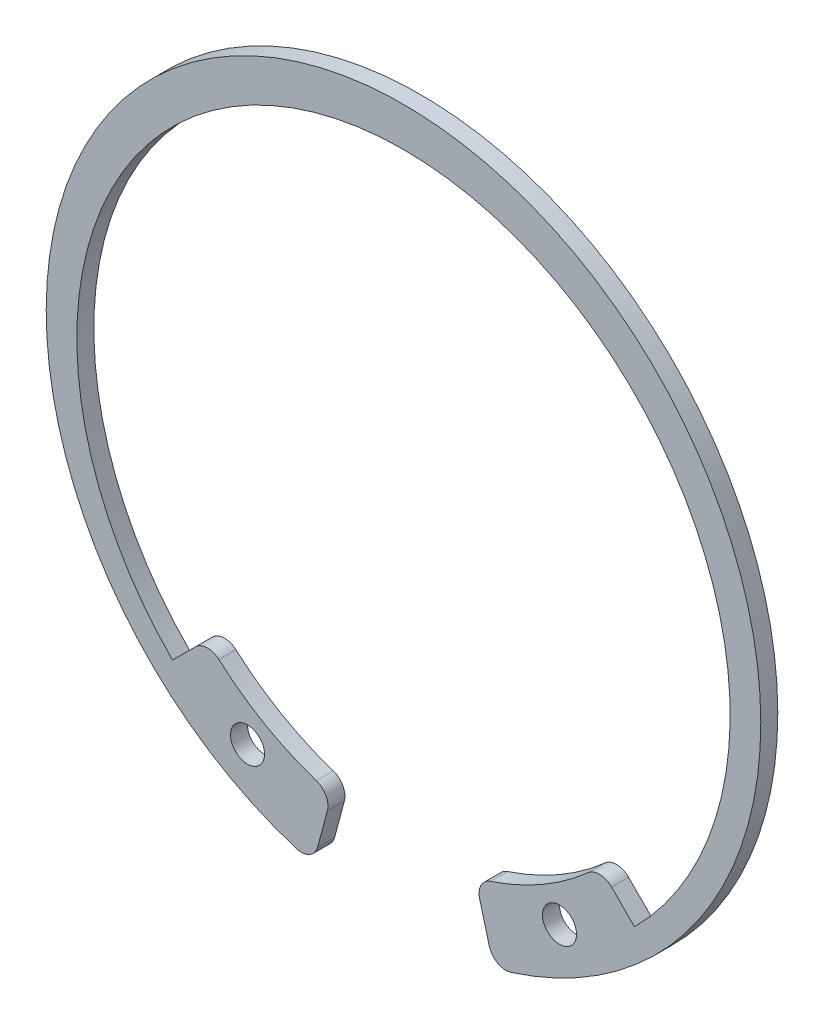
ISO-10303-21;
HEADER;
FILE_DESCRIPTION(('STEP AP214'),'2;1');
FILE_NAME('part.step','',(''),(''),'','','');
FILE_SCHEMA(('AUTOMOTIVE_DESIGN { 1 0 10303 214 1 1 1 1 }'));
ENDSEC;
DATA;
#1=APPLICATION_CONTEXT('core data for automotive mechanical design processes');
#2=APPLICATION_PROTOCOL_DEFINITION('international standard','automotive_design',2000,#1);
#3=PRODUCT_CONTEXT('',#1,'mechanical');
#4=PRODUCT('Part','Part','',(#3));
#5=PRODUCT_RELATED_PRODUCT_CATEGORY('part','',(#4));
#6=PRODUCT_DEFINITION_FORMATION('','',#4);
#7=PRODUCT_DEFINITION_CONTEXT('part definition',#1,'design');
#8=PRODUCT_DEFINITION('design','',#6,#7);
#9=PRODUCT_DEFINITION_SHAPE('','',#8);
#10=(LENGTH_UNIT() NAMED_UNIT(*) SI_UNIT(.MILLI.,.METRE.));
#11=(NAMED_UNIT(*) PLANE_ANGLE_UNIT() SI_UNIT($,.RADIAN.));
#12=(NAMED_UNIT(*) SI_UNIT($,.STERADIAN.) SOLID_ANGLE_UNIT());
#13=UNCERTAINTY_MEASURE_WITH_UNIT(LENGTH_MEASURE(1.E-05),#10,'distance_accuracy_value','');
#14=(GEOMETRIC_REPRESENTATION_CONTEXT(3) GLOBAL_UNCERTAINTY_ASSIGNED_CONTEXT((#13)) GLOBAL_UNIT_ASSIGNED_CONTEXT((#10,
#11,#12)) REPRESENTATION_CONTEXT('',''));
#15=CARTESIAN_POINT('',(0.,0.,0.));
#16=DIRECTION('',(0.,0.,1.));
#17=DIRECTION('',(1.,0.,0.));
#18=AXIS2_PLACEMENT_3D('',#15,#16,#17);
#19=CARTESIAN_POINT('',(11.5171715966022,-12.9313851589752,1.));
#20=DIRECTION('',(0.,0.,-1.));
#21=DIRECTION('',(-1.,0.,0.));
#22=AXIS2_PLACEMENT_3D('',#19,#20,#21);
#23=PLANE('',#22);
#24=CARTESIAN_POINT('',(-9.16844281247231,-15.6713185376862,1.));
#25=DIRECTION('',(0.,0.,1.));
#26=DIRECTION('',(1.,0.,0.));
#27=AXIS2_PLACEMENT_3D('',#24,#25,#26);
#28=CIRCLE('',#27,1.);
#29=CARTESIAN_POINT('',(-8.16844281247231,-15.6713185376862,1.));
#30=VERTEX_POINT('',#29);
#31=EDGE_CURVE('E150',#30,#30,#28,.T.);
#32=ORIENTED_EDGE('',*,*,#31,.F.);
#33=EDGE_LOOP('',(#32));
#34=FACE_BOUND('',#33,.T.);
#35=CARTESIAN_POINT('',(11.5171715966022,-12.9313851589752,1.));
#36=DIRECTION('',(0.,0.,1.));
#37=DIRECTION('',(-1.,0.,0.));
#38=AXIS2_PLACEMENT_3D('',#35,#36,#37);
#39=CIRCLE('',#38,1.);
#40=CARTESIAN_POINT('',(12.2242783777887,-12.2242783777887,1.));
#41=VERTEX_POINT('',#40);
#42=CARTESIAN_POINT('',(10.8520787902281,-12.184624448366,1.));
#43=VERTEX_POINT('',#42);
#44=EDGE_CURVE('E180',#41,#43,#39,.T.);
#45=ORIENTED_EDGE('',*,*,#44,.T.);
#46=CARTESIAN_POINT('',(0.,0.,1.));
#47=DIRECTION('',(0.,0.,-1.));
#48=DIRECTION('',(1.,0.,0.));
#49=AXIS2_PLACEMENT_3D('',#46,#47,#48);
#50=CIRCLE('',#49,16.3166383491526);
#51=CARTESIAN_POINT('',(5.12615491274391,-15.4904881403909,1.));
#52=VERTEX_POINT('',#51);
#53=EDGE_CURVE('E145',#43,#52,#50,.T.);
#54=ORIENTED_EDGE('',*,*,#53,.T.);
#55=CARTESIAN_POINT('',(5.44032225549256,-16.4398557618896,1.));
#56=DIRECTION('',(0.,0.,1.));
#57=DIRECTION('',(-1.,0.,0.));
#58=AXIS2_PLACEMENT_3D('',#55,#56,#57);
#59=CIRCLE('',#58,1.);
#60=CARTESIAN_POINT('',(4.4743964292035,-16.6986748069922,1.));
#61=VERTEX_POINT('',#60);
#62=EDGE_CURVE('E183',#52,#61,#59,.T.);
#63=ORIENTED_EDGE('',*,*,#62,.T.);
#64=DIRECTION('',(0.258819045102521,-0.965925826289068,0.));
#65=VECTOR('',#64,1.);
#66=CARTESIAN_POINT('',(5.04647442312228,-18.8336989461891,1.));
#67=LINE('',#66,#65);
#68=CARTESIAN_POINT('',(5.04647442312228,-18.8336989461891,1.));
#69=VERTEX_POINT('',#68);
#70=EDGE_CURVE('E185',#61,#69,#67,.T.);
#71=ORIENTED_EDGE('',*,*,#70,.T.);
#72=CARTESIAN_POINT('',(6.01240024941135,-18.5748799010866,1.));
#73=DIRECTION('',(0.,0.,1.));
#74=DIRECTION('',(-1.,0.,0.));
#75=AXIS2_PLACEMENT_3D('',#72,#73,#74);
#76=CIRCLE('',#75,1.);
#77=CARTESIAN_POINT('',(6.31302026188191,-19.528623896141,1.));
#78=VERTEX_POINT('',#77);
#79=EDGE_CURVE('E187',#69,#78,#76,.T.);
#80=ORIENTED_EDGE('',*,*,#79,.T.);
#81=CARTESIAN_POINT('',(0.,0.5,1.));
#82=DIRECTION('',(0.,0.,1.));
#83=DIRECTION('',(1.,0.,0.));
#84=AXIS2_PLACEMENT_3D('',#81,#82,#83);
#85=CIRCLE('',#84,21.);
#86=CARTESIAN_POINT('',(-6.31302026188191,-19.528623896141,1.));
#87=VERTEX_POINT('',#86);
#88=EDGE_CURVE('E189',#78,#87,#85,.T.);
#89=ORIENTED_EDGE('',*,*,#88,.T.);
#90=CARTESIAN_POINT('',(-6.01240024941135,-18.5748799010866,1.));
#91=DIRECTION('',(0.,0.,1.));
#92=DIRECTION('',(1.,0.,0.));
#93=AXIS2_PLACEMENT_3D('',#90,#91,#92);
#94=CIRCLE('',#93,1.);
#95=CARTESIAN_POINT('',(-5.04647442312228,-18.8336989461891,1.));
#96=VERTEX_POINT('',#95);
#97=EDGE_CURVE('E191',#87,#96,#94,.T.);
#98=ORIENTED_EDGE('',*,*,#97,.T.);
#99=DIRECTION('',(0.258819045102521,0.965925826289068,0.));
#100=VECTOR('',#99,1.);
#101=CARTESIAN_POINT('',(-5.04647442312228,-18.8336989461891,1.));
#102=LINE('',#101,#100);
#103=CARTESIAN_POINT('',(-4.4743964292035,-16.6986748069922,1.));
#104=VERTEX_POINT('',#103);
#105=EDGE_CURVE('E193',#96,#104,#102,.T.);
#106=ORIENTED_EDGE('',*,*,#105,.T.);
#107=CARTESIAN_POINT('',(-5.44032225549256,-16.4398557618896,1.));
#108=DIRECTION('',(0.,0.,1.));
#109=DIRECTION('',(1.,0.,0.));
#110=AXIS2_PLACEMENT_3D('',#107,#108,#109);
#111=CIRCLE('',#110,1.);
#112=CARTESIAN_POINT('',(-5.12615491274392,-15.4904881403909,1.));
#113=VERTEX_POINT('',#112);
#114=EDGE_CURVE('E195',#104,#113,#111,.T.);
#115=ORIENTED_EDGE('',*,*,#114,.T.);
#116=CARTESIAN_POINT('',(0.,0.,1.));
#117=DIRECTION('',(0.,0.,-1.));
#118=DIRECTION('',(1.,0.,0.));
#119=AXIS2_PLACEMENT_3D('',#116,#117,#118);
#120=CIRCLE('',#119,16.3166383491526);
#121=CARTESIAN_POINT('',(-10.8520787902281,-12.184624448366,1.));
#122=VERTEX_POINT('',#121);
#123=EDGE_CURVE('E197',#113,#122,#120,.T.);
#124=ORIENTED_EDGE('',*,*,#123,.T.);
#125=CARTESIAN_POINT('',(-11.5171715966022,-12.9313851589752,1.));
#126=DIRECTION('',(0.,0.,1.));
#127=DIRECTION('',(-1.,0.,0.));
#128=AXIS2_PLACEMENT_3D('',#125,#126,#127);
#129=CIRCLE('',#128,1.);
#130=CARTESIAN_POINT('',(-12.2242783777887,-12.2242783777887,1.));
#131=VERTEX_POINT('',#130);
#132=EDGE_CURVE('E199',#122,#131,#129,.T.);
#133=ORIENTED_EDGE('',*,*,#132,.T.);
#134=DIRECTION('',(-0.707106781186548,-0.707106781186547,0.));
#135=VECTOR('',#134,1.);
#136=CARTESIAN_POINT('',(-12.2242783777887,-12.2242783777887,1.));
#137=LINE('',#136,#135);
#138=CARTESIAN_POINT('',(-13.5764501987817,-13.5764501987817,1.));
#139=VERTEX_POINT('',#138);
#140=EDGE_CURVE('E201',#131,#139,#137,.T.);
#141=ORIENTED_EDGE('',*,*,#140,.T.);
#142=CARTESIAN_POINT('',(0.,0.,1.));
#143=DIRECTION('',(0.,0.,-1.));
#144=DIRECTION('',(1.,0.,0.));
#145=AXIS2_PLACEMENT_3D('',#142,#143,#144);
#146=CIRCLE('',#145,19.2);
#147=CARTESIAN_POINT('',(13.5764501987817,-13.5764501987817,1.));
#148=VERTEX_POINT('',#147);
#149=EDGE_CURVE('E50',#139,#148,#146,.T.);
#150=ORIENTED_EDGE('',*,*,#149,.T.);
#151=DIRECTION('',(-0.707106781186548,0.707106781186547,0.));
#152=VECTOR('',#151,1.);
#153=CARTESIAN_POINT('',(12.2242783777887,-12.2242783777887,1.));
#154=LINE('',#153,#152);
#155=EDGE_CURVE('E45',#148,#41,#154,.T.);
#156=ORIENTED_EDGE('',*,*,#155,.T.);
#157=EDGE_LOOP('',(#45,#54,#63,#71,#80,#89,#98,#106,#115,#124,#133,#141,#150,#156));
#158=FACE_BOUND('',#157,.T.);
#159=CARTESIAN_POINT('',(9.16844281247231,-15.6713185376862,1.));
#160=DIRECTION('',(0.,0.,1.));
#161=DIRECTION('',(-1.,0.,0.));
#162=AXIS2_PLACEMENT_3D('',#159,#160,#161);
#163=CIRCLE('',#162,0.999999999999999);
#164=CARTESIAN_POINT('',(8.16844281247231,-15.6713185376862,1.));
#165=VERTEX_POINT('',#164);
#166=EDGE_CURVE('E320',#165,#165,#163,.T.);
#167=ORIENTED_EDGE('',*,*,#166,.F.);
#168=EDGE_LOOP('',(#167));
#169=FACE_BOUND('',#168,.T.);
#170=ADVANCED_FACE('F30',(#34,#158,#169),#23,.F.);
#171=CARTESIAN_POINT('',(11.5171715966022,-12.9313851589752,0.));
#172=DIRECTION('',(0.,0.,-1.));
#173=DIRECTION('',(-1.,0.,0.));
#174=AXIS2_PLACEMENT_3D('',#171,#172,#173);
#175=PLANE('',#174);
#176=CARTESIAN_POINT('',(-9.16844281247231,-15.6713185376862,0.));
#177=DIRECTION('',(0.,0.,1.));
#178=DIRECTION('',(1.,0.,0.));
#179=AXIS2_PLACEMENT_3D('',#176,#177,#178);
#180=CIRCLE('',#179,1.);
#181=CARTESIAN_POINT('',(-8.16844281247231,-15.6713185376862,0.));
#182=VERTEX_POINT('',#181);
#183=EDGE_CURVE('E153',#182,#182,#180,.T.);
#184=ORIENTED_EDGE('',*,*,#183,.T.);
#185=EDGE_LOOP('',(#184));
#186=FACE_BOUND('',#185,.T.);
#187=CARTESIAN_POINT('',(11.5171715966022,-12.9313851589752,0.));
#188=DIRECTION('',(0.,0.,1.));
#189=DIRECTION('',(-1.,0.,0.));
#190=AXIS2_PLACEMENT_3D('',#187,#188,#189);
#191=CIRCLE('',#190,1.);
#192=CARTESIAN_POINT('',(12.2242783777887,-12.2242783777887,0.));
#193=VERTEX_POINT('',#192);
#194=CARTESIAN_POINT('',(10.8520787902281,-12.184624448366,0.));
#195=VERTEX_POINT('',#194);
#196=EDGE_CURVE('E136',#193,#195,#191,.T.);
#197=ORIENTED_EDGE('',*,*,#196,.F.);
#198=DIRECTION('',(-0.707106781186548,0.707106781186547,0.));
#199=VECTOR('',#198,1.);
#200=CARTESIAN_POINT('',(12.2242783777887,-12.2242783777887,0.));
#201=LINE('',#200,#199);
#202=CARTESIAN_POINT('',(13.5764501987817,-13.5764501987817,0.));
#203=VERTEX_POINT('',#202);
#204=EDGE_CURVE('E178',#203,#193,#201,.T.);
#205=ORIENTED_EDGE('',*,*,#204,.F.);
#206=CARTESIAN_POINT('',(0.,0.,0.));
#207=DIRECTION('',(0.,0.,-1.));
#208=DIRECTION('',(1.,0.,0.));
#209=AXIS2_PLACEMENT_3D('',#206,#207,#208);
#210=CIRCLE('',#209,19.2);
#211=CARTESIAN_POINT('',(-13.5764501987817,-13.5764501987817,0.));
#212=VERTEX_POINT('',#211);
#213=EDGE_CURVE('E176',#212,#203,#210,.T.);
#214=ORIENTED_EDGE('',*,*,#213,.F.);
#215=DIRECTION('',(-0.707106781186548,-0.707106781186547,0.));
#216=VECTOR('',#215,1.);
#217=CARTESIAN_POINT('',(-12.2242783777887,-12.2242783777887,0.));
#218=LINE('',#217,#216);
#219=CARTESIAN_POINT('',(-12.2242783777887,-12.2242783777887,0.));
#220=VERTEX_POINT('',#219);
#221=EDGE_CURVE('E174',#220,#212,#218,.T.);
#222=ORIENTED_EDGE('',*,*,#221,.F.);
#223=CARTESIAN_POINT('',(-11.5171715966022,-12.9313851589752,0.));
#224=DIRECTION('',(0.,0.,1.));
#225=DIRECTION('',(-1.,0.,0.));
#226=AXIS2_PLACEMENT_3D('',#223,#224,#225);
#227=CIRCLE('',#226,1.);
#228=CARTESIAN_POINT('',(-10.8520787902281,-12.184624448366,0.));
#229=VERTEX_POINT('',#228);
#230=EDGE_CURVE('E172',#229,#220,#227,.T.);
#231=ORIENTED_EDGE('',*,*,#230,.F.);
#232=CARTESIAN_POINT('',(0.,0.,0.));
#233=DIRECTION('',(0.,0.,-1.));
#234=DIRECTION('',(1.,0.,0.));
#235=AXIS2_PLACEMENT_3D('',#232,#233,#234);
#236=CIRCLE('',#235,16.3166383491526);
#237=CARTESIAN_POINT('',(-5.12615491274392,-15.4904881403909,0.));
#238=VERTEX_POINT('',#237);
#239=EDGE_CURVE('E170',#238,#229,#236,.T.);
#240=ORIENTED_EDGE('',*,*,#239,.F.);
#241=CARTESIAN_POINT('',(-5.44032225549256,-16.4398557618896,0.));
#242=DIRECTION('',(0.,0.,1.));
#243=DIRECTION('',(1.,0.,0.));
#244=AXIS2_PLACEMENT_3D('',#241,#242,#243);
#245=CIRCLE('',#244,1.);
#246=CARTESIAN_POINT('',(-4.4743964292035,-16.6986748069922,0.));
#247=VERTEX_POINT('',#246);
#248=EDGE_CURVE('E168',#247,#238,#245,.T.);
#249=ORIENTED_EDGE('',*,*,#248,.F.);
#250=DIRECTION('',(0.258819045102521,0.965925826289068,0.));
#251=VECTOR('',#250,1.);
#252=CARTESIAN_POINT('',(-5.04647442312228,-18.8336989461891,0.));
#253=LINE('',#252,#251);
#254=CARTESIAN_POINT('',(-5.04647442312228,-18.8336989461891,0.));
#255=VERTEX_POINT('',#254);
#256=EDGE_CURVE('E166',#255,#247,#253,.T.);
#257=ORIENTED_EDGE('',*,*,#256,.F.);
#258=CARTESIAN_POINT('',(-6.01240024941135,-18.5748799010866,0.));
#259=DIRECTION('',(0.,0.,1.));
#260=DIRECTION('',(1.,0.,0.));
#261=AXIS2_PLACEMENT_3D('',#258,#259,#260);
#262=CIRCLE('',#261,1.);
#263=CARTESIAN_POINT('',(-6.31302026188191,-19.528623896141,0.));
#264=VERTEX_POINT('',#263);
#265=EDGE_CURVE('E164',#264,#255,#262,.T.);
#266=ORIENTED_EDGE('',*,*,#265,.F.);
#267=CARTESIAN_POINT('',(0.,0.5,0.));
#268=DIRECTION('',(0.,0.,1.));
#269=DIRECTION('',(1.,0.,0.));
#270=AXIS2_PLACEMENT_3D('',#267,#268,#269);
#271=CIRCLE('',#270,21.);
#272=CARTESIAN_POINT('',(6.31302026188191,-19.528623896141,0.));
#273=VERTEX_POINT('',#272);
#274=EDGE_CURVE('E162',#273,#264,#271,.T.);
#275=ORIENTED_EDGE('',*,*,#274,.F.);
#276=CARTESIAN_POINT('',(6.01240024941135,-18.5748799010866,0.));
#277=DIRECTION('',(0.,0.,1.));
#278=DIRECTION('',(-1.,0.,0.));
#279=AXIS2_PLACEMENT_3D('',#276,#277,#278);
#280=CIRCLE('',#279,1.);
#281=CARTESIAN_POINT('',(5.04647442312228,-18.8336989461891,0.));
#282=VERTEX_POINT('',#281);
#283=EDGE_CURVE('E160',#282,#273,#280,.T.);
#284=ORIENTED_EDGE('',*,*,#283,.F.);
#285=DIRECTION('',(0.258819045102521,-0.965925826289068,0.));
#286=VECTOR('',#285,1.);
#287=CARTESIAN_POINT('',(5.04647442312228,-18.8336989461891,0.));
#288=LINE('',#287,#286);
#289=CARTESIAN_POINT('',(4.4743964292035,-16.6986748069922,0.));
#290=VERTEX_POINT('',#289);
#291=EDGE_CURVE('E158',#290,#282,#288,.T.);
#292=ORIENTED_EDGE('',*,*,#291,.F.);
#293=CARTESIAN_POINT('',(5.44032225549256,-16.4398557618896,0.));
#294=DIRECTION('',(0.,0.,1.));
#295=DIRECTION('',(-1.,0.,0.));
#296=AXIS2_PLACEMENT_3D('',#293,#294,#295);
#297=CIRCLE('',#296,1.);
#298=CARTESIAN_POINT('',(5.12615491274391,-15.4904881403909,0.));
#299=VERTEX_POINT('',#298);
#300=EDGE_CURVE('E138',#299,#290,#297,.T.);
#301=ORIENTED_EDGE('',*,*,#300,.F.);
#302=CARTESIAN_POINT('',(0.,0.,0.));
#303=DIRECTION('',(0.,0.,-1.));
#304=DIRECTION('',(1.,0.,0.));
#305=AXIS2_PLACEMENT_3D('',#302,#303,#304);
#306=CIRCLE('',#305,16.3166383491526);
#307=EDGE_CURVE('E131',#195,#299,#306,.T.);
#308=ORIENTED_EDGE('',*,*,#307,.F.);
#309=EDGE_LOOP('',(#197,#205,#214,#222,#231,#240,#249,#257,#266,#275,#284,#292,#301,#308));
#310=FACE_BOUND('',#309,.T.);
#311=CARTESIAN_POINT('',(9.16844281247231,-15.6713185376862,0.));
#312=DIRECTION('',(0.,0.,1.));
#313=DIRECTION('',(-1.,0.,0.));
#314=AXIS2_PLACEMENT_3D('',#311,#312,#313);
#315=CIRCLE('',#314,0.999999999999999);
#316=CARTESIAN_POINT('',(8.16844281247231,-15.6713185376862,0.));
#317=VERTEX_POINT('',#316);
#318=EDGE_CURVE('E323',#317,#317,#315,.T.);
#319=ORIENTED_EDGE('',*,*,#318,.T.);
#320=EDGE_LOOP('',(#319));
#321=FACE_BOUND('',#320,.T.);
#322=ADVANCED_FACE('F132',(#186,#310,#321),#175,.T.);
#323=CARTESIAN_POINT('',(11.5171715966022,-12.9313851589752,1.));
#324=DIRECTION('',(0.,0.,-1.));
#325=DIRECTION('',(-1.,0.,0.));
#326=AXIS2_PLACEMENT_3D('',#323,#324,#325);
#327=CYLINDRICAL_SURFACE('',#326,1.);
#328=ORIENTED_EDGE('',*,*,#196,.T.);
#329=DIRECTION('',(0.,0.,-1.));
#330=VECTOR('',#329,1.);
#331=CARTESIAN_POINT('',(10.8520787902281,-12.184624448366,1.));
#332=LINE('',#331,#330);
#333=EDGE_CURVE('E11',#43,#195,#332,.T.);
#334=ORIENTED_EDGE('',*,*,#333,.F.);
#335=ORIENTED_EDGE('',*,*,#44,.F.);
#336=DIRECTION('',(0.,0.,-1.));
#337=VECTOR('',#336,1.);
#338=CARTESIAN_POINT('',(12.2242783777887,-12.2242783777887,1.));
#339=LINE('',#338,#337);
#340=EDGE_CURVE('E149',#41,#193,#339,.T.);
#341=ORIENTED_EDGE('',*,*,#340,.T.);
#342=EDGE_LOOP('',(#328,#334,#335,#341));
#343=FACE_BOUND('',#342,.T.);
#344=ADVANCED_FACE('F32',(#343),#327,.T.);
#345=CARTESIAN_POINT('',(0.,0.,1.));
#346=DIRECTION('',(0.,0.,-1.));
#347=DIRECTION('',(-1.,0.,0.));
#348=AXIS2_PLACEMENT_3D('',#345,#346,#347);
#349=CYLINDRICAL_SURFACE('',#348,16.3166383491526);
#350=ORIENTED_EDGE('',*,*,#307,.T.);
#351=DIRECTION('',(0.,0.,-1.));
#352=VECTOR('',#351,1.);
#353=CARTESIAN_POINT('',(5.12615491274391,-15.4904881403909,1.));
#354=LINE('',#353,#352);
#355=EDGE_CURVE('E38',#52,#299,#354,.T.);
#356=ORIENTED_EDGE('',*,*,#355,.F.);
#357=ORIENTED_EDGE('',*,*,#53,.F.);
#358=ORIENTED_EDGE('',*,*,#333,.T.);
#359=EDGE_LOOP('',(#350,#356,#357,#358));
#360=FACE_BOUND('',#359,.T.);
#361=ADVANCED_FACE('F144',(#360),#349,.F.);
#362=CARTESIAN_POINT('',(5.44032225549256,-16.4398557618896,1.));
#363=DIRECTION('',(0.,0.,-1.));
#364=DIRECTION('',(-1.,0.,0.));
#365=AXIS2_PLACEMENT_3D('',#362,#363,#364);
#366=CYLINDRICAL_SURFACE('',#365,1.);
#367=ORIENTED_EDGE('',*,*,#300,.T.);
#368=DIRECTION('',(0.,0.,-1.));
#369=VECTOR('',#368,1.);
#370=CARTESIAN_POINT('',(4.4743964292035,-16.6986748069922,1.));
#371=LINE('',#370,#369);
#372=EDGE_CURVE('E236',#61,#290,#371,.T.);
#373=ORIENTED_EDGE('',*,*,#372,.F.);
#374=ORIENTED_EDGE('',*,*,#62,.F.);
#375=ORIENTED_EDGE('',*,*,#355,.T.);
#376=EDGE_LOOP('',(#367,#373,#374,#375));
#377=FACE_BOUND('',#376,.T.);
#378=ADVANCED_FACE('F240',(#377),#366,.T.);
#379=CARTESIAN_POINT('',(5.04647442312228,-18.8336989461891,1.));
#380=DIRECTION('',(0.965925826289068,0.258819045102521,0.));
#381=DIRECTION('',(-0.258819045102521,0.965925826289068,0.));
#382=AXIS2_PLACEMENT_3D('',#379,#380,#381);
#383=PLANE('',#382);
#384=ORIENTED_EDGE('',*,*,#291,.T.);
#385=DIRECTION('',(0.,0.,-1.));
#386=VECTOR('',#385,1.);
#387=CARTESIAN_POINT('',(5.04647442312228,-18.8336989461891,1.));
#388=LINE('',#387,#386);
#389=EDGE_CURVE('E233',#69,#282,#388,.T.);
#390=ORIENTED_EDGE('',*,*,#389,.F.);
#391=ORIENTED_EDGE('',*,*,#70,.F.);
#392=ORIENTED_EDGE('',*,*,#372,.T.);
#393=EDGE_LOOP('',(#384,#390,#391,#392));
#394=FACE_BOUND('',#393,.T.);
#395=ADVANCED_FACE('F248',(#394),#383,.F.);
#396=CARTESIAN_POINT('',(6.01240024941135,-18.5748799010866,1.));
#397=DIRECTION('',(0.,0.,-1.));
#398=DIRECTION('',(-1.,0.,0.));
#399=AXIS2_PLACEMENT_3D('',#396,#397,#398);
#400=CYLINDRICAL_SURFACE('',#399,1.);
#401=ORIENTED_EDGE('',*,*,#283,.T.);
#402=DIRECTION('',(0.,0.,-1.));
#403=VECTOR('',#402,1.);
#404=CARTESIAN_POINT('',(6.31302026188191,-19.528623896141,1.));
#405=LINE('',#404,#403);
#406=EDGE_CURVE('E230',#78,#273,#405,.T.);
#407=ORIENTED_EDGE('',*,*,#406,.F.);
#408=ORIENTED_EDGE('',*,*,#79,.F.);
#409=ORIENTED_EDGE('',*,*,#389,.T.);
#410=EDGE_LOOP('',(#401,#407,#408,#409));
#411=FACE_BOUND('',#410,.T.);
#412=ADVANCED_FACE('F251',(#411),#400,.T.);
#413=CARTESIAN_POINT('',(0.,0.5,1.));
#414=DIRECTION('',(0.,0.,-1.));
#415=DIRECTION('',(-1.,0.,0.));
#416=AXIS2_PLACEMENT_3D('',#413,#414,#415);
#417=CYLINDRICAL_SURFACE('',#416,21.);
#418=ORIENTED_EDGE('',*,*,#274,.T.);
#419=DIRECTION('',(0.,0.,-1.));
#420=VECTOR('',#419,1.);
#421=CARTESIAN_POINT('',(-6.31302026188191,-19.528623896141,1.));
#422=LINE('',#421,#420);
#423=EDGE_CURVE('E227',#87,#264,#422,.T.);
#424=ORIENTED_EDGE('',*,*,#423,.F.);
#425=ORIENTED_EDGE('',*,*,#88,.F.);
#426=ORIENTED_EDGE('',*,*,#406,.T.);
#427=EDGE_LOOP('',(#418,#424,#425,#426));
#428=FACE_BOUND('',#427,.T.);
#429=ADVANCED_FACE('F256',(#428),#417,.T.);
#430=CARTESIAN_POINT('',(-6.01240024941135,-18.5748799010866,1.));
#431=DIRECTION('',(0.,0.,-1.));
#432=DIRECTION('',(-1.,0.,0.));
#433=AXIS2_PLACEMENT_3D('',#430,#431,#432);
#434=CYLINDRICAL_SURFACE('',#433,1.);
#435=ORIENTED_EDGE('',*,*,#265,.T.);
#436=DIRECTION('',(0.,0.,-1.));
#437=VECTOR('',#436,1.);
#438=CARTESIAN_POINT('',(-5.04647442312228,-18.8336989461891,1.));
#439=LINE('',#438,#437);
#440=EDGE_CURVE('E224',#96,#255,#439,.T.);
#441=ORIENTED_EDGE('',*,*,#440,.F.);
#442=ORIENTED_EDGE('',*,*,#97,.F.);
#443=ORIENTED_EDGE('',*,*,#423,.T.);
#444=EDGE_LOOP('',(#435,#441,#442,#443));
#445=FACE_BOUND('',#444,.T.);
#446=ADVANCED_FACE('F262',(#445),#434,.T.);
#447=CARTESIAN_POINT('',(-5.04647442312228,-18.8336989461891,1.));
#448=DIRECTION('',(-0.965925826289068,0.258819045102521,0.));
#449=DIRECTION('',(-0.258819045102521,-0.965925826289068,0.));
#450=AXIS2_PLACEMENT_3D('',#447,#448,#449);
#451=PLANE('',#450);
#452=ORIENTED_EDGE('',*,*,#256,.T.);
#453=DIRECTION('',(0.,0.,-1.));
#454=VECTOR('',#453,1.);
#455=CARTESIAN_POINT('',(-4.4743964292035,-16.6986748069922,1.));
#456=LINE('',#455,#454);
#457=EDGE_CURVE('E221',#104,#247,#456,.T.);
#458=ORIENTED_EDGE('',*,*,#457,.F.);
#459=ORIENTED_EDGE('',*,*,#105,.F.);
#460=ORIENTED_EDGE('',*,*,#440,.T.);
#461=EDGE_LOOP('',(#452,#458,#459,#460));
#462=FACE_BOUND('',#461,.T.);
#463=ADVANCED_FACE('F266',(#462),#451,.F.);
#464=CARTESIAN_POINT('',(-5.44032225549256,-16.4398557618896,1.));
#465=DIRECTION('',(0.,0.,-1.));
#466=DIRECTION('',(-1.,0.,0.));
#467=AXIS2_PLACEMENT_3D('',#464,#465,#466);
#468=CYLINDRICAL_SURFACE('',#467,1.);
#469=ORIENTED_EDGE('',*,*,#248,.T.);
#470=DIRECTION('',(0.,0.,-1.));
#471=VECTOR('',#470,1.);
#472=CARTESIAN_POINT('',(-5.12615491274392,-15.4904881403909,1.));
#473=LINE('',#472,#471);
#474=EDGE_CURVE('E218',#113,#238,#473,.T.);
#475=ORIENTED_EDGE('',*,*,#474,.F.);
#476=ORIENTED_EDGE('',*,*,#114,.F.);
#477=ORIENTED_EDGE('',*,*,#457,.T.);
#478=EDGE_LOOP('',(#469,#475,#476,#477));
#479=FACE_BOUND('',#478,.T.);
#480=ADVANCED_FACE('F271',(#479),#468,.T.);
#481=CARTESIAN_POINT('',(0.,0.,1.));
#482=DIRECTION('',(0.,0.,-1.));
#483=DIRECTION('',(-1.,0.,0.));
#484=AXIS2_PLACEMENT_3D('',#481,#482,#483);
#485=CYLINDRICAL_SURFACE('',#484,16.3166383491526);
#486=ORIENTED_EDGE('',*,*,#239,.T.);
#487=DIRECTION('',(0.,0.,-1.));
#488=VECTOR('',#487,1.);
#489=CARTESIAN_POINT('',(-10.8520787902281,-12.184624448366,1.));
#490=LINE('',#489,#488);
#491=EDGE_CURVE('E215',#122,#229,#490,.T.);
#492=ORIENTED_EDGE('',*,*,#491,.F.);
#493=ORIENTED_EDGE('',*,*,#123,.F.);
#494=ORIENTED_EDGE('',*,*,#474,.T.);
#495=EDGE_LOOP('',(#486,#492,#493,#494));
#496=FACE_BOUND('',#495,.T.);
#497=ADVANCED_FACE('F277',(#496),#485,.F.);
#498=CARTESIAN_POINT('',(-11.5171715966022,-12.9313851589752,1.));
#499=DIRECTION('',(0.,0.,-1.));
#500=DIRECTION('',(-1.,0.,0.));
#501=AXIS2_PLACEMENT_3D('',#498,#499,#500);
#502=CYLINDRICAL_SURFACE('',#501,1.);
#503=ORIENTED_EDGE('',*,*,#230,.T.);
#504=DIRECTION('',(0.,0.,-1.));
#505=VECTOR('',#504,1.);
#506=CARTESIAN_POINT('',(-12.2242783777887,-12.2242783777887,1.));
#507=LINE('',#506,#505);
#508=EDGE_CURVE('E212',#131,#220,#507,.T.);
#509=ORIENTED_EDGE('',*,*,#508,.F.);
#510=ORIENTED_EDGE('',*,*,#132,.F.);
#511=ORIENTED_EDGE('',*,*,#491,.T.);
#512=EDGE_LOOP('',(#503,#509,#510,#511));
#513=FACE_BOUND('',#512,.T.);
#514=ADVANCED_FACE('F281',(#513),#502,.T.);
#515=CARTESIAN_POINT('',(-12.2242783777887,-12.2242783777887,1.));
#516=DIRECTION('',(0.707106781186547,-0.707106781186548,0.));
#517=DIRECTION('',(0.707106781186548,0.707106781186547,0.));
#518=AXIS2_PLACEMENT_3D('',#515,#516,#517);
#519=PLANE('',#518);
#520=ORIENTED_EDGE('',*,*,#221,.T.);
#521=DIRECTION('',(0.,0.,-1.));
#522=VECTOR('',#521,1.);
#523=CARTESIAN_POINT('',(-13.5764501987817,-13.5764501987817,1.));
#524=LINE('',#523,#522);
#525=EDGE_CURVE('E209',#139,#212,#524,.T.);
#526=ORIENTED_EDGE('',*,*,#525,.F.);
#527=ORIENTED_EDGE('',*,*,#140,.F.);
#528=ORIENTED_EDGE('',*,*,#508,.T.);
#529=EDGE_LOOP('',(#520,#526,#527,#528));
#530=FACE_BOUND('',#529,.T.);
#531=ADVANCED_FACE('F286',(#530),#519,.F.);
#532=CARTESIAN_POINT('',(0.,0.,1.));
#533=DIRECTION('',(0.,0.,-1.));
#534=DIRECTION('',(-1.,0.,0.));
#535=AXIS2_PLACEMENT_3D('',#532,#533,#534);
#536=CYLINDRICAL_SURFACE('',#535,19.2);
#537=ORIENTED_EDGE('',*,*,#213,.T.);
#538=DIRECTION('',(0.,0.,-1.));
#539=VECTOR('',#538,1.);
#540=CARTESIAN_POINT('',(13.5764501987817,-13.5764501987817,1.));
#541=LINE('',#540,#539);
#542=EDGE_CURVE('E206',#148,#203,#541,.T.);
#543=ORIENTED_EDGE('',*,*,#542,.F.);
#544=ORIENTED_EDGE('',*,*,#149,.F.);
#545=ORIENTED_EDGE('',*,*,#525,.T.);
#546=EDGE_LOOP('',(#537,#543,#544,#545));
#547=FACE_BOUND('',#546,.T.);
#548=ADVANCED_FACE('F289',(#547),#536,.F.);
#549=CARTESIAN_POINT('',(12.2242783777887,-12.2242783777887,1.));
#550=DIRECTION('',(-0.707106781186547,-0.707106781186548,0.));
#551=DIRECTION('',(0.707106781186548,-0.707106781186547,0.));
#552=AXIS2_PLACEMENT_3D('',#549,#550,#551);
#553=PLANE('',#552);
#554=ORIENTED_EDGE('',*,*,#204,.T.);
#555=ORIENTED_EDGE('',*,*,#340,.F.);
#556=ORIENTED_EDGE('',*,*,#155,.F.);
#557=ORIENTED_EDGE('',*,*,#542,.T.);
#558=EDGE_LOOP('',(#554,#555,#556,#557));
#559=FACE_BOUND('',#558,.T.);
#560=ADVANCED_FACE('F291',(#559),#553,.F.);
#561=CARTESIAN_POINT('',(-9.16844281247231,-15.6713185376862,1.));
#562=DIRECTION('',(0.,0.,-1.));
#563=DIRECTION('',(-1.,0.,0.));
#564=AXIS2_PLACEMENT_3D('',#561,#562,#563);
#565=CYLINDRICAL_SURFACE('',#564,1.);
#566=ORIENTED_EDGE('',*,*,#31,.T.);
#567=EDGE_LOOP('',(#566));
#568=FACE_BOUND('',#567,.T.);
#569=ORIENTED_EDGE('',*,*,#183,.F.);
#570=EDGE_LOOP('',(#569));
#571=FACE_BOUND('',#570,.T.);
#572=ADVANCED_FACE('F293',(#568,#571),#565,.F.);
#573=CARTESIAN_POINT('',(9.16844281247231,-15.6713185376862,1.));
#574=DIRECTION('',(0.,0.,-1.));
#575=DIRECTION('',(-1.,0.,0.));
#576=AXIS2_PLACEMENT_3D('',#573,#574,#575);
#577=CYLINDRICAL_SURFACE('',#576,0.999999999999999);
#578=ORIENTED_EDGE('',*,*,#166,.T.);
#579=EDGE_LOOP('',(#578));
#580=FACE_BOUND('',#579,.T.);
#581=ORIENTED_EDGE('',*,*,#318,.F.);
#582=EDGE_LOOP('',(#581));
#583=FACE_BOUND('',#582,.T.);
#584=ADVANCED_FACE('F299',(#580,#583),#577,.F.);
#585=CLOSED_SHELL('',(#170,#322,#344,#361,#378,#395,#412,#429,#446,#463,#480,#497,#514,#531,
#548,#560,#572,#584));
#586=MANIFOLD_SOLID_BREP('B2',#585);
#587=ADVANCED_BREP_SHAPE_REPRESENTATION('',(#18,#586),#14);
#588=SHAPE_DEFINITION_REPRESENTATION(#9,#587);
ENDSEC;
END-ISO-10303-21;
